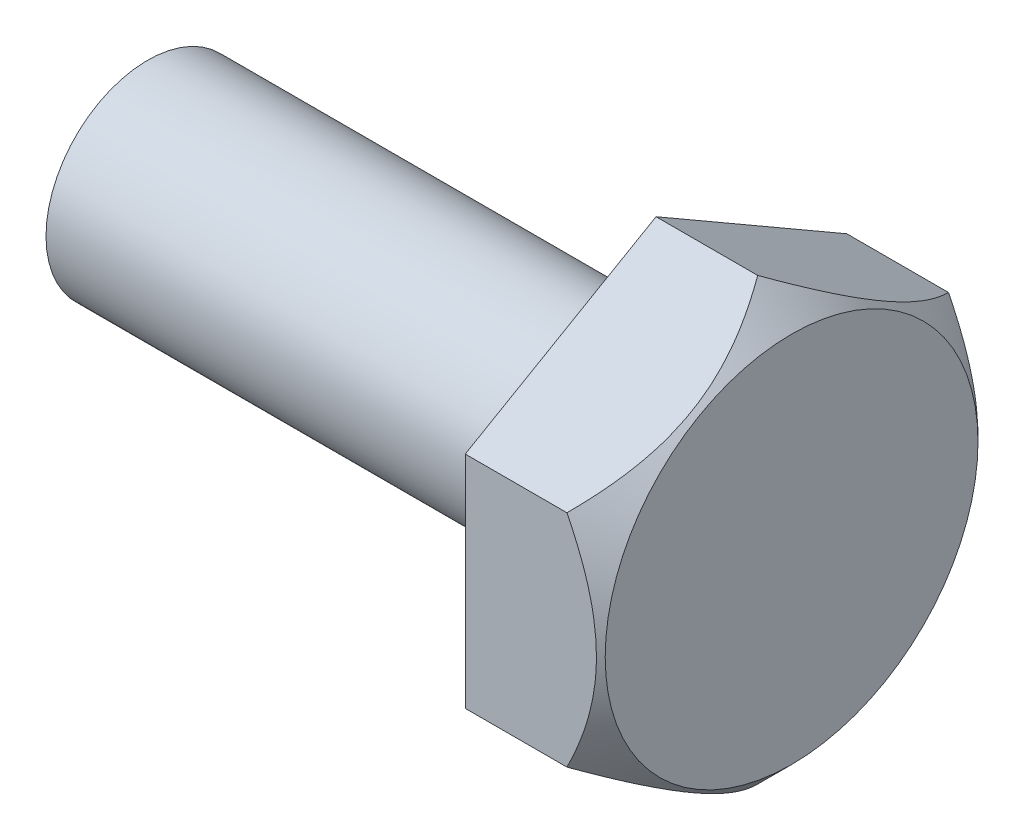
from build123d import *

# Parameters (mm, degrees)
CHANFREIN1_SIZE         = 1
ESQUISSE2_OUTSIDE_W     = 20.288
ESQUISSE2_OUTSIDE_H     = 20.288
ENL_V_MAT_EXTRU_1_DEPTH = 10


with BuildPart() as part:
    # Esquisse1 → R_volution1 (revolve)
    with BuildSketch(Plane.XY, mode=Mode.PRIVATE) as r_volution1_sk:
        Polygon((0, 0), (-19, 0), (-19, 3), (-4, 3), (-4, 6.5), (0, 6.5), align=None)
    revolve(r_volution1_sk.sketch.rotate(Axis((0, 0, 0), (1, 0, 0)), 90), axis=Axis((0, 0, 0), (1, 0, 0)))

    # Chanfrein1
    chanfrein1_edges = [part.edges().sort_by_distance(p)[0] for p in [
        (0, 0, -6.5),
    ]]
    chamfer(chanfrein1_edges, length=CHANFREIN1_SIZE)

    # Esquisse2 outside → Enl_v. mat.-Extru.1 (cut)
    with BuildSketch(Plane(origin=(0, 0, 0), x_dir=(0, 0, -1), z_dir=(1, 0, 0))):
        Rectangle(ESQUISSE2_OUTSIDE_W, ESQUISSE2_OUTSIDE_H)
        Polygon((0, 6.5), (-5.629165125, 3.25), (-5.629165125, -3.25), (0, -6.5), (5.629165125, -3.25), (5.629165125, 3.25), align=None, mode=Mode.SUBTRACT)
    extrude(amount=-ENL_V_MAT_EXTRU_1_DEPTH, mode=Mode.SUBTRACT)


solid = part.part
